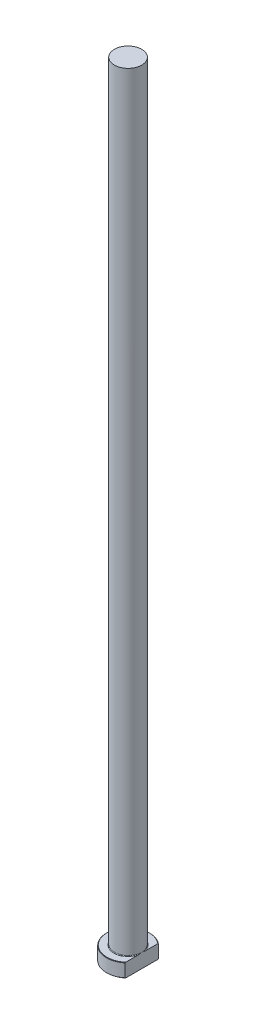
ISO-10303-21;
HEADER;
FILE_DESCRIPTION(('STEP AP214'),'2;1');
FILE_NAME('part.step','',(''),(''),'','','');
FILE_SCHEMA(('AUTOMOTIVE_DESIGN { 1 0 10303 214 1 1 1 1 }'));
ENDSEC;
DATA;
#1=APPLICATION_CONTEXT('core data for automotive mechanical design processes');
#2=APPLICATION_PROTOCOL_DEFINITION('international standard','automotive_design',2000,#1);
#3=PRODUCT_CONTEXT('',#1,'mechanical');
#4=PRODUCT('Part','Part','',(#3));
#5=PRODUCT_RELATED_PRODUCT_CATEGORY('part','',(#4));
#6=PRODUCT_DEFINITION_FORMATION('','',#4);
#7=PRODUCT_DEFINITION_CONTEXT('part definition',#1,'design');
#8=PRODUCT_DEFINITION('design','',#6,#7);
#9=PRODUCT_DEFINITION_SHAPE('','',#8);
#10=(LENGTH_UNIT() NAMED_UNIT(*) SI_UNIT(.MILLI.,.METRE.));
#11=(NAMED_UNIT(*) PLANE_ANGLE_UNIT() SI_UNIT($,.RADIAN.));
#12=(NAMED_UNIT(*) SI_UNIT($,.STERADIAN.) SOLID_ANGLE_UNIT());
#13=UNCERTAINTY_MEASURE_WITH_UNIT(LENGTH_MEASURE(1.E-05),#10,'distance_accuracy_value','');
#14=(GEOMETRIC_REPRESENTATION_CONTEXT(3) GLOBAL_UNCERTAINTY_ASSIGNED_CONTEXT((#13)) GLOBAL_UNIT_ASSIGNED_CONTEXT((#10,
#11,#12)) REPRESENTATION_CONTEXT('',''));
#15=CARTESIAN_POINT('',(0.,0.,0.));
#16=DIRECTION('',(0.,0.,1.));
#17=DIRECTION('',(1.,0.,0.));
#18=AXIS2_PLACEMENT_3D('',#15,#16,#17);
#19=CARTESIAN_POINT('',(0.,0.,0.));
#20=DIRECTION('',(0.,-1.,0.));
#21=DIRECTION('',(0.,0.,-1.));
#22=AXIS2_PLACEMENT_3D('',#19,#20,#21);
#23=PLANE('',#22);
#24=CARTESIAN_POINT('',(0.,0.,0.));
#25=DIRECTION('',(0.,-1.,0.));
#26=DIRECTION('',(0.,0.,-1.));
#27=AXIS2_PLACEMENT_3D('',#24,#25,#26);
#28=CIRCLE('',#27,10.7999999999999);
#29=CARTESIAN_POINT('',(6.99999999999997,0.,8.22435407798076));
#30=VERTEX_POINT('',#29);
#31=CARTESIAN_POINT('',(6.99999999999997,0.,-8.22435407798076));
#32=VERTEX_POINT('',#31);
#33=EDGE_CURVE('E98',#30,#32,#28,.T.);
#34=ORIENTED_EDGE('',*,*,#33,.T.);
#35=DIRECTION('',(0.,0.,1.));
#36=VECTOR('',#35,1.);
#37=CARTESIAN_POINT('',(6.99999999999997,0.,-8.48528137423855));
#38=LINE('',#37,#36);
#39=EDGE_CURVE('E83',#32,#30,#38,.T.);
#40=ORIENTED_EDGE('',*,*,#39,.T.);
#41=EDGE_LOOP('',(#34,#40));
#42=FACE_BOUND('',#41,.T.);
#43=ADVANCED_FACE('F32',(#42),#23,.T.);
#44=CARTESIAN_POINT('',(0.,259.958771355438,0.));
#45=DIRECTION('',(0.,1.,0.));
#46=DIRECTION('',(0.,0.,1.));
#47=AXIS2_PLACEMENT_3D('',#44,#45,#46);
#48=CYLINDRICAL_SURFACE('',#47,11.);
#49=CARTESIAN_POINT('',(0.,6.79999999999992,0.));
#50=DIRECTION('',(0.,1.,0.));
#51=DIRECTION('',(0.,0.,1.));
#52=AXIS2_PLACEMENT_3D('',#49,#50,#51);
#53=CIRCLE('',#52,11.);
#54=CARTESIAN_POINT('',(6.99999999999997,6.79999999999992,8.48528137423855));
#55=VERTEX_POINT('',#54);
#56=CARTESIAN_POINT('',(6.99999999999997,6.79999999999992,-8.48528137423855));
#57=VERTEX_POINT('',#56);
#58=EDGE_CURVE('E104',#55,#57,#53,.F.);
#59=ORIENTED_EDGE('',*,*,#58,.T.);
#60=DIRECTION('',(0.,-1.,0.));
#61=VECTOR('',#60,1.);
#62=CARTESIAN_POINT('',(6.99999999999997,400.,-8.48528137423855));
#63=LINE('',#62,#61);
#64=CARTESIAN_POINT('',(6.99999999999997,0.200000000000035,-8.48528137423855));
#65=VERTEX_POINT('',#64);
#66=EDGE_CURVE('E183',#57,#65,#63,.T.);
#67=ORIENTED_EDGE('',*,*,#66,.T.);
#68=CARTESIAN_POINT('',(0.,0.200000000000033,0.));
#69=DIRECTION('',(0.,-1.,0.));
#70=DIRECTION('',(0.,0.,-1.));
#71=AXIS2_PLACEMENT_3D('',#68,#69,#70);
#72=CIRCLE('',#71,11.);
#73=CARTESIAN_POINT('',(6.99999999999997,0.200000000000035,8.48528137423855));
#74=VERTEX_POINT('',#73);
#75=EDGE_CURVE('E100',#65,#74,#72,.F.);
#76=ORIENTED_EDGE('',*,*,#75,.T.);
#77=DIRECTION('',(0.,-1.,0.));
#78=VECTOR('',#77,1.);
#79=CARTESIAN_POINT('',(6.99999999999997,400.,8.48528137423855));
#80=LINE('',#79,#78);
#81=EDGE_CURVE('E93',#55,#74,#80,.T.);
#82=ORIENTED_EDGE('',*,*,#81,.F.);
#83=EDGE_LOOP('',(#59,#67,#76,#82));
#84=FACE_BOUND('',#83,.T.);
#85=ADVANCED_FACE('F158',(#84),#48,.T.);
#86=CARTESIAN_POINT('',(-11.,7.,0.));
#87=DIRECTION('',(0.,1.,0.));
#88=DIRECTION('',(0.,0.,1.));
#89=AXIS2_PLACEMENT_3D('',#86,#87,#88);
#90=PLANE('',#89);
#91=CARTESIAN_POINT('',(0.,7.,0.));
#92=DIRECTION('',(0.,1.,0.));
#93=DIRECTION('',(0.,0.,1.));
#94=AXIS2_PLACEMENT_3D('',#91,#92,#93);
#95=CIRCLE('',#94,10.7999999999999);
#96=CARTESIAN_POINT('',(6.99999999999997,7.,-8.22435407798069));
#97=VERTEX_POINT('',#96);
#98=CARTESIAN_POINT('',(6.99999999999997,7.,8.22435407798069));
#99=VERTEX_POINT('',#98);
#100=EDGE_CURVE('E178',#97,#99,#95,.T.);
#101=ORIENTED_EDGE('',*,*,#100,.T.);
#102=DIRECTION('',(0.,0.,-1.));
#103=VECTOR('',#102,1.);
#104=CARTESIAN_POINT('',(6.99999999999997,7.,0.));
#105=LINE('',#104,#103);
#106=CARTESIAN_POINT('',(6.99999999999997,6.99999999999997,2.07123151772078));
#107=VERTEX_POINT('',#106);
#108=EDGE_CURVE('E57',#99,#107,#105,.T.);
#109=ORIENTED_EDGE('',*,*,#108,.T.);
#110=CARTESIAN_POINT('',(0.,7.,0.));
#111=DIRECTION('',(0.,1.,0.));
#112=DIRECTION('',(0.,0.,1.));
#113=AXIS2_PLACEMENT_3D('',#110,#111,#112);
#114=CIRCLE('',#113,7.29999999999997);
#115=CARTESIAN_POINT('',(6.99999999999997,6.99999999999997,-2.07123151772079));
#116=VERTEX_POINT('',#115);
#117=EDGE_CURVE('E107',#107,#116,#114,.F.);
#118=ORIENTED_EDGE('',*,*,#117,.T.);
#119=EDGE_CURVE('E136',#116,#97,#105,.T.);
#120=ORIENTED_EDGE('',*,*,#119,.T.);
#121=EDGE_LOOP('',(#101,#109,#118,#120));
#122=FACE_BOUND('',#121,.T.);
#123=ADVANCED_FACE('F147',(#122),#90,.T.);
#124=CARTESIAN_POINT('',(0.,7.00000000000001,0.));
#125=DIRECTION('',(0.,-1.,0.));
#126=DIRECTION('',(0.,0.,-1.));
#127=AXIS2_PLACEMENT_3D('',#124,#125,#126);
#128=CONICAL_SURFACE('',#127,10.7999999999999,0.785398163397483);
#129=ORIENTED_EDGE('',*,*,#58,.F.);
#130=CARTESIAN_POINT('',(6.99999999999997,-2.13774979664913,18.6685261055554));
#131=CARTESIAN_POINT('',(6.99999999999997,-1.86574872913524,18.3780244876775));
#132=CARTESIAN_POINT('',(6.99999999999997,-1.59415659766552,18.0871392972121));
#133=CARTESIAN_POINT('',(6.99999999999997,-1.05192877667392,17.5044755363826));
#134=CARTESIAN_POINT('',(6.99999999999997,-0.781293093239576,17.2126969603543));
#135=CARTESIAN_POINT('',(6.99999999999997,-0.241050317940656,16.6280482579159));
#136=CARTESIAN_POINT('',(6.99999999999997,0.0285564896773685,16.335177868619));
#137=CARTESIAN_POINT('',(6.99999999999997,0.566485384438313,15.7482616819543));
#138=CARTESIAN_POINT('',(6.99999999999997,0.834807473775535,15.4542158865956));
#139=CARTESIAN_POINT('',(6.99999999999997,1.64198377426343,14.5651645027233));
#140=CARTESIAN_POINT('',(6.99999999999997,2.17856420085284,13.9680841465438));
#141=CARTESIAN_POINT('',(6.99999999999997,2.9769633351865,13.0668144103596));
#142=CARTESIAN_POINT('',(6.99999999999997,3.24199785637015,12.7654727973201));
#143=CARTESIAN_POINT('',(6.99999999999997,3.76945856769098,12.1605141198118));
#144=CARTESIAN_POINT('',(6.99999999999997,4.03188476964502,11.8568970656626));
#145=CARTESIAN_POINT('',(6.99999999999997,4.50733797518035,11.3009625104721));
#146=CARTESIAN_POINT('',(6.99999999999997,4.72088020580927,11.0490858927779));
#147=CARTESIAN_POINT('',(6.99999999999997,5.14538078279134,10.5431655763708));
#148=CARTESIAN_POINT('',(6.99999999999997,5.35633915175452,10.2891218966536));
#149=CARTESIAN_POINT('',(6.99999999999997,5.77522964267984,9.77836737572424));
#150=CARTESIAN_POINT('',(6.99999999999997,5.98316044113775,9.5216554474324));
#151=CARTESIAN_POINT('',(6.99999999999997,6.3952109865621,9.00519084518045));
#152=CARTESIAN_POINT('',(6.99999999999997,6.59933078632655,8.74543821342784));
#153=CARTESIAN_POINT('',(6.99999999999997,7.00243445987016,8.22283607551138));
#154=CARTESIAN_POINT('',(6.99999999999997,7.2014281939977,7.95999419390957));
#155=CARTESIAN_POINT('',(6.99999999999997,7.59353840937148,7.42991856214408));
#156=CARTESIAN_POINT('',(6.99999999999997,7.78665447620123,7.1626845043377));
#157=CARTESIAN_POINT('',(6.99999999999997,8.16523718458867,6.62311113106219));
#158=CARTESIAN_POINT('',(6.99999999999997,8.35070911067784,6.35077553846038));
#159=CARTESIAN_POINT('',(6.99999999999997,8.71189725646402,5.79973731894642));
#160=CARTESIAN_POINT('',(6.99999999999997,8.88761537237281,5.52103594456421));
#161=CARTESIAN_POINT('',(6.99999999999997,9.19554959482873,5.00707921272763));
#162=CARTESIAN_POINT('',(6.99999999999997,9.32988075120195,4.77309669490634));
#163=CARTESIAN_POINT('',(6.99999999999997,9.58764253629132,4.29911523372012));
#164=CARTESIAN_POINT('',(6.99999999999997,9.71107181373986,4.05911554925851));
#165=CARTESIAN_POINT('',(6.99999999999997,9.94390907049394,3.57263619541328));
#166=CARTESIAN_POINT('',(6.99999999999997,10.0533307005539,3.32616312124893));
#167=CARTESIAN_POINT('',(6.99999999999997,10.2545146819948,2.82607166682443));
#168=CARTESIAN_POINT('',(6.99999999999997,10.3462820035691,2.57245532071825));
#169=CARTESIAN_POINT('',(6.99999999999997,10.4907049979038,2.11254447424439));
#170=CARTESIAN_POINT('',(6.99999999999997,10.5475277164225,1.90756611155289));
#171=CARTESIAN_POINT('',(6.99999999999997,10.6452043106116,1.49381161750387));
#172=CARTESIAN_POINT('',(6.99999999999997,10.68606033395,1.28503600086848));
#173=CARTESIAN_POINT('',(6.99999999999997,10.7497550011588,0.865342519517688));
#174=CARTESIAN_POINT('',(6.99999999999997,10.7726462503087,0.654432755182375));
#175=CARTESIAN_POINT('',(6.99999999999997,10.7993569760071,0.231396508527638));
#176=CARTESIAN_POINT('',(6.99999999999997,10.8031771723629,0.0192700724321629));
#177=CARTESIAN_POINT('',(6.99999999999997,10.7915178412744,-0.404715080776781));
#178=CARTESIAN_POINT('',(6.99999999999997,10.7760135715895,-0.616573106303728));
#179=CARTESIAN_POINT('',(6.99999999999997,10.7265413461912,-1.03810446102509));
#180=CARTESIAN_POINT('',(6.99999999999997,10.6925718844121,-1.24777761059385));
#181=CARTESIAN_POINT('',(6.99999999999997,10.6077703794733,-1.66430273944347));
#182=CARTESIAN_POINT('',(6.99999999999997,10.5568873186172,-1.87114418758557));
#183=CARTESIAN_POINT('',(6.99999999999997,10.4404729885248,-2.28061279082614));
#184=CARTESIAN_POINT('',(6.99999999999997,10.3749414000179,-2.48323985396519));
#185=CARTESIAN_POINT('',(6.99999999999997,10.219098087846,-2.9186026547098));
#186=CARTESIAN_POINT('',(6.99999999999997,10.1264616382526,-3.15050038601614));
#187=CARTESIAN_POINT('',(6.99999999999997,9.92740958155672,-3.60835455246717));
#188=CARTESIAN_POINT('',(6.99999999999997,9.82098769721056,-3.83430822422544));
#189=CARTESIAN_POINT('',(6.99999999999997,9.5969514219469,-4.28105341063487));
#190=CARTESIAN_POINT('',(6.99999999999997,9.47931762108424,-4.50183511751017));
#191=CARTESIAN_POINT('',(6.99999999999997,9.2352423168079,-4.93840249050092));
#192=CARTESIAN_POINT('',(6.99999999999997,9.10880204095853,-5.15418884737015));
#193=CARTESIAN_POINT('',(6.99999999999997,8.84714657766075,-5.58417945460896));
#194=CARTESIAN_POINT('',(6.99999999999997,8.71183920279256,-5.79832734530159));
#195=CARTESIAN_POINT('',(6.99999999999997,8.43533082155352,-6.22277635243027));
#196=CARTESIAN_POINT('',(6.99999999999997,8.29412966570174,-6.4330773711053));
#197=CARTESIAN_POINT('',(6.99999999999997,8.00706556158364,-6.85014007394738));
#198=CARTESIAN_POINT('',(6.99999999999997,7.86120763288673,-7.0569052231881));
#199=CARTESIAN_POINT('',(6.99999999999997,7.56553131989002,-7.46757278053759));
#200=CARTESIAN_POINT('',(6.99999999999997,7.41571298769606,-7.67147522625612));
#201=CARTESIAN_POINT('',(6.99999999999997,7.07999705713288,-8.12067189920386));
#202=CARTESIAN_POINT('',(6.99999999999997,6.89330819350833,-8.36537403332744));
#203=CARTESIAN_POINT('',(6.99999999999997,6.51597189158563,-8.85171196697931));
#204=CARTESIAN_POINT('',(6.99999999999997,6.3253243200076,-9.09334766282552));
#205=CARTESIAN_POINT('',(6.99999999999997,5.94076020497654,-9.57404667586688));
#206=CARTESIAN_POINT('',(6.99999999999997,5.74684327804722,-9.81310968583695));
#207=CARTESIAN_POINT('',(6.99999999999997,5.35630729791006,-10.2890203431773));
#208=CARTESIAN_POINT('',(6.99999999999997,5.15968820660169,-10.5258679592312));
#209=CARTESIAN_POINT('',(6.99999999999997,4.56606953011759,-11.2340330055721));
#210=CARTESIAN_POINT('',(6.99999999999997,4.16568148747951,-11.702510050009));
#211=CARTESIAN_POINT('',(6.99999999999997,3.35840033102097,-12.633824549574));
#212=CARTESIAN_POINT('',(6.99999999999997,2.95150704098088,-13.0966618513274));
#213=CARTESIAN_POINT('',(6.99999999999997,2.35017562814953,-13.7734103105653));
#214=CARTESIAN_POINT('',(6.99999999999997,2.15763812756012,-13.9890143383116));
#215=CARTESIAN_POINT('',(6.99999999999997,1.77161609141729,-14.4193671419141));
#216=CARTESIAN_POINT('',(6.99999999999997,1.57813157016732,-14.6341159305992));
#217=CARTESIAN_POINT('',(6.99999999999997,0.996412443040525,-15.2772388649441));
#218=CARTESIAN_POINT('',(6.99999999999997,0.606922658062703,-15.7044779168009));
#219=CARTESIAN_POINT('',(6.99999999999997,-0.173895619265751,-16.5556520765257));
#220=CARTESIAN_POINT('',(6.99999999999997,-0.565218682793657,-16.9795921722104));
#221=CARTESIAN_POINT('',(6.99999999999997,-1.34999931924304,-17.8254589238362));
#222=CARTESIAN_POINT('',(6.99999999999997,-1.74345679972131,-18.2473856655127));
#223=CARTESIAN_POINT('',(6.99999999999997,-2.13774979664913,-18.6685261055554));
#224=B_SPLINE_CURVE_WITH_KNOTS('',3,(#130,#131,#132,#133,#134,#135,#136,#137,#138,#139,#140,
#141,#142,#143,#144,#145,#146,#147,#148,#149,#150,#151,#152,#153,#154,#155,#156,#157,#158,#159,
#160,#161,#162,#163,#164,#165,#166,#167,#168,#169,#170,#171,#172,#173,#174,#175,#176,#177,#178,
#179,#180,#181,#182,#183,#184,#185,#186,#187,#188,#189,#190,#191,#192,#193,#194,#195,#196,#197,
#198,#199,#200,#201,#202,#203,#204,#205,#206,#207,#208,#209,#210,#211,#212,#213,#214,#215,#216,
#217,#218,#219,#220,#221,#222,#223),.UNSPECIFIED.,.F.,.F.,(4,2,2,2,2,2,2,2,2,2,2,2,2,2,2,2,2,2,
2,2,2,2,2,2,2,2,2,2,2,2,2,2,2,2,2,2,2,2,2,2,2,2,2,2,2,2,4),(0.,1.19389386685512,
2.38779531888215,3.58200567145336,4.77621398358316,7.18442154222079,8.38834194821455,
9.59225689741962,10.5828886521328,11.5735117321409,12.5645555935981,13.5555857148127,
14.5445404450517,15.5335647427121,16.5218934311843,17.5100293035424,18.3192088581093,
19.1284885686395,19.9369735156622,20.7452305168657,21.3828127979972,22.0203092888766,
22.6559319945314,23.2915307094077,23.9279440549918,24.5644093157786,25.2028120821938,
25.8412287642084,26.5898097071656,27.3387327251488,28.0889766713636,28.8391162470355,
29.5989369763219,30.3587769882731,31.1178239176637,31.876860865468,32.8001653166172,
33.7235009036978,34.6469455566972,35.5704032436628,37.4191008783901,39.2678486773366,
40.1350269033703,41.0021920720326,42.7365692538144,44.4673795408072,46.1981154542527),.UNSPECIFIED.);
#225=EDGE_CURVE('E135',#55,#99,#224,.T.);
#226=ORIENTED_EDGE('',*,*,#225,.T.);
#227=ORIENTED_EDGE('',*,*,#100,.F.);
#228=EDGE_CURVE('E127',#97,#57,#224,.T.);
#229=ORIENTED_EDGE('',*,*,#228,.T.);
#230=EDGE_LOOP('',(#129,#226,#227,#229));
#231=FACE_BOUND('',#230,.T.);
#232=ADVANCED_FACE('F143',(#231),#128,.T.);
#233=CARTESIAN_POINT('',(0.,0.200000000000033,0.));
#234=DIRECTION('',(0.,1.,0.));
#235=DIRECTION('',(0.,0.,1.));
#236=AXIS2_PLACEMENT_3D('',#233,#234,#235);
#237=CONICAL_SURFACE('',#236,11.,0.785398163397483);
#238=ORIENTED_EDGE('',*,*,#75,.F.);
#239=CARTESIAN_POINT('',(6.99999999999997,9.13774979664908,-18.6685261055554));
#240=CARTESIAN_POINT('',(6.99999999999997,8.86574872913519,-18.3780244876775));
#241=CARTESIAN_POINT('',(6.99999999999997,8.59415659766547,-18.0871392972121));
#242=CARTESIAN_POINT('',(6.99999999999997,8.05192877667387,-17.5044755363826));
#243=CARTESIAN_POINT('',(6.99999999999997,7.78129309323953,-17.2126969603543));
#244=CARTESIAN_POINT('',(6.99999999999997,7.24105031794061,-16.6280482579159));
#245=CARTESIAN_POINT('',(6.99999999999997,6.97144351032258,-16.335177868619));
#246=CARTESIAN_POINT('',(6.99999999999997,6.43351461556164,-15.7482616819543));
#247=CARTESIAN_POINT('',(6.99999999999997,6.16519252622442,-15.4542158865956));
#248=CARTESIAN_POINT('',(6.99999999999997,5.35801622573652,-14.5651645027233));
#249=CARTESIAN_POINT('',(6.99999999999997,4.82143579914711,-13.9680841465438));
#250=CARTESIAN_POINT('',(6.99999999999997,4.02303666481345,-13.0668144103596));
#251=CARTESIAN_POINT('',(6.99999999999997,3.7580021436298,-12.7654727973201));
#252=CARTESIAN_POINT('',(6.99999999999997,3.23054143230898,-12.1605141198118));
#253=CARTESIAN_POINT('',(6.99999999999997,2.96811523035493,-11.8568970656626));
#254=CARTESIAN_POINT('',(6.99999999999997,2.4926620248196,-11.3009625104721));
#255=CARTESIAN_POINT('',(6.99999999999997,2.27911979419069,-11.0490858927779));
#256=CARTESIAN_POINT('',(6.99999999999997,1.85461921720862,-10.5431655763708));
#257=CARTESIAN_POINT('',(6.99999999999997,1.64366084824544,-10.2891218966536));
#258=CARTESIAN_POINT('',(6.99999999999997,1.22477035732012,-9.77836737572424));
#259=CARTESIAN_POINT('',(6.99999999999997,1.0168395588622,-9.52165544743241));
#260=CARTESIAN_POINT('',(6.99999999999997,0.60478901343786,-9.00519084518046));
#261=CARTESIAN_POINT('',(6.99999999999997,0.400669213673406,-8.74543821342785));
#262=CARTESIAN_POINT('',(6.99999999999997,-0.00243445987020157,-8.2228360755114));
#263=CARTESIAN_POINT('',(6.99999999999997,-0.201428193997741,-7.95999419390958));
#264=CARTESIAN_POINT('',(6.99999999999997,-0.593538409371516,-7.4299185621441));
#265=CARTESIAN_POINT('',(6.99999999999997,-0.786654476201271,-7.16268450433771));
#266=CARTESIAN_POINT('',(6.99999999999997,-1.16523718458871,-6.6231111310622));
#267=CARTESIAN_POINT('',(6.99999999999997,-1.35070911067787,-6.3507755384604));
#268=CARTESIAN_POINT('',(6.99999999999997,-1.71189725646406,-5.79973731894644));
#269=CARTESIAN_POINT('',(6.99999999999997,-1.88761537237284,-5.52103594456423));
#270=CARTESIAN_POINT('',(6.99999999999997,-2.19554959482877,-5.00707921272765));
#271=CARTESIAN_POINT('',(6.99999999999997,-2.32988075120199,-4.77309669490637));
#272=CARTESIAN_POINT('',(6.99999999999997,-2.58764253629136,-4.29911523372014));
#273=CARTESIAN_POINT('',(6.99999999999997,-2.7110718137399,-4.05911554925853));
#274=CARTESIAN_POINT('',(6.99999999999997,-2.94390907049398,-3.5726361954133));
#275=CARTESIAN_POINT('',(6.99999999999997,-3.05333070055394,-3.32616312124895));
#276=CARTESIAN_POINT('',(6.99999999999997,-3.25451468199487,-2.82607166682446));
#277=CARTESIAN_POINT('',(6.99999999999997,-3.34628200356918,-2.57245532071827));
#278=CARTESIAN_POINT('',(6.99999999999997,-3.49070499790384,-2.11254447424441));
#279=CARTESIAN_POINT('',(6.99999999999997,-3.54752771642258,-1.90756611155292));
#280=CARTESIAN_POINT('',(6.99999999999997,-3.64520431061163,-1.49381161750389));
#281=CARTESIAN_POINT('',(6.99999999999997,-3.68606033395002,-1.2850360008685));
#282=CARTESIAN_POINT('',(6.99999999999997,-3.74975500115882,-0.865342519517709));
#283=CARTESIAN_POINT('',(6.99999999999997,-3.77264625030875,-0.654432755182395));
#284=CARTESIAN_POINT('',(6.99999999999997,-3.79935697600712,-0.231396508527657));
#285=CARTESIAN_POINT('',(6.99999999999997,-3.80317717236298,-0.0192700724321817));
#286=CARTESIAN_POINT('',(6.99999999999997,-3.79151784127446,0.404715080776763));
#287=CARTESIAN_POINT('',(6.99999999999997,-3.77601357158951,0.61657310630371));
#288=CARTESIAN_POINT('',(6.99999999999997,-3.72654134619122,1.03810446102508));
#289=CARTESIAN_POINT('',(6.99999999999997,-3.69257188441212,1.24777761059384));
#290=CARTESIAN_POINT('',(6.99999999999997,-3.60777037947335,1.66430273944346));
#291=CARTESIAN_POINT('',(6.99999999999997,-3.55688731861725,1.87114418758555));
#292=CARTESIAN_POINT('',(6.99999999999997,-3.44047298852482,2.28061279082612));
#293=CARTESIAN_POINT('',(6.99999999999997,-3.374941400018,2.48323985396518));
#294=CARTESIAN_POINT('',(6.99999999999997,-3.2190980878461,2.91860265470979));
#295=CARTESIAN_POINT('',(6.99999999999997,-3.12646163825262,3.15050038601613));
#296=CARTESIAN_POINT('',(6.99999999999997,-2.92740958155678,3.60835455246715));
#297=CARTESIAN_POINT('',(6.99999999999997,-2.82098769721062,3.83430822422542));
#298=CARTESIAN_POINT('',(6.99999999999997,-2.59695142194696,4.28105341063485));
#299=CARTESIAN_POINT('',(6.99999999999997,-2.4793176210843,4.50183511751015));
#300=CARTESIAN_POINT('',(6.99999999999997,-2.23524231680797,4.9384024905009));
#301=CARTESIAN_POINT('',(6.99999999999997,-2.1088020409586,5.15418884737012));
#302=CARTESIAN_POINT('',(6.99999999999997,-1.84714657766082,5.58417945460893));
#303=CARTESIAN_POINT('',(6.99999999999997,-1.71183920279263,5.79832734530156));
#304=CARTESIAN_POINT('',(6.99999999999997,-1.43533082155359,6.22277635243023));
#305=CARTESIAN_POINT('',(6.99999999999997,-1.29412966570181,6.43307737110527));
#306=CARTESIAN_POINT('',(6.99999999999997,-1.00706556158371,6.85014007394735));
#307=CARTESIAN_POINT('',(6.99999999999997,-0.861207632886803,7.05690522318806));
#308=CARTESIAN_POINT('',(6.99999999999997,-0.5655313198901,7.46757278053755));
#309=CARTESIAN_POINT('',(6.99999999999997,-0.415712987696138,7.67147522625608));
#310=CARTESIAN_POINT('',(6.99999999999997,-0.0799970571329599,8.12067189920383));
#311=CARTESIAN_POINT('',(6.99999999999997,0.10669180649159,8.36537403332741));
#312=CARTESIAN_POINT('',(6.99999999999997,0.484028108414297,8.85171196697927));
#313=CARTESIAN_POINT('',(6.99999999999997,0.674675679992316,9.09334766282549));
#314=CARTESIAN_POINT('',(6.99999999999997,1.05923979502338,9.57404667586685));
#315=CARTESIAN_POINT('',(6.99999999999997,1.25315672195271,9.81310968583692));
#316=CARTESIAN_POINT('',(6.99999999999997,1.64369270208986,10.2890203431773));
#317=CARTESIAN_POINT('',(6.99999999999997,1.84031179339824,10.5258679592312));
#318=CARTESIAN_POINT('',(6.99999999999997,2.43393046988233,11.2340330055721));
#319=CARTESIAN_POINT('',(6.99999999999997,2.83431851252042,11.702510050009));
#320=CARTESIAN_POINT('',(6.99999999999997,3.64159966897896,12.633824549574));
#321=CARTESIAN_POINT('',(6.99999999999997,4.04849295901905,13.0966618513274));
#322=CARTESIAN_POINT('',(6.99999999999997,4.64982437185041,13.7734103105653));
#323=CARTESIAN_POINT('',(6.99999999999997,4.84236187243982,13.9890143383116));
#324=CARTESIAN_POINT('',(6.99999999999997,5.22838390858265,14.4193671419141));
#325=CARTESIAN_POINT('',(6.99999999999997,5.42186842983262,14.6341159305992));
#326=CARTESIAN_POINT('',(6.99999999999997,6.00358755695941,15.2772388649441));
#327=CARTESIAN_POINT('',(6.99999999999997,6.39307734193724,15.7044779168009));
#328=CARTESIAN_POINT('',(6.99999999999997,7.17389561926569,16.5556520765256));
#329=CARTESIAN_POINT('',(6.99999999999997,7.5652186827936,16.9795921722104));
#330=CARTESIAN_POINT('',(6.99999999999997,8.34999931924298,17.8254589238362));
#331=CARTESIAN_POINT('',(6.99999999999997,8.74345679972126,18.2473856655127));
#332=CARTESIAN_POINT('',(6.99999999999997,9.13774979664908,18.6685261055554));
#333=B_SPLINE_CURVE_WITH_KNOTS('',3,(#239,#240,#241,#242,#243,#244,#245,#246,#247,#248,#249,
#250,#251,#252,#253,#254,#255,#256,#257,#258,#259,#260,#261,#262,#263,#264,#265,#266,#267,#268,
#269,#270,#271,#272,#273,#274,#275,#276,#277,#278,#279,#280,#281,#282,#283,#284,#285,#286,#287,
#288,#289,#290,#291,#292,#293,#294,#295,#296,#297,#298,#299,#300,#301,#302,#303,#304,#305,#306,
#307,#308,#309,#310,#311,#312,#313,#314,#315,#316,#317,#318,#319,#320,#321,#322,#323,#324,#325,
#326,#327,#328,#329,#330,#331,#332),.UNSPECIFIED.,.F.,.F.,(4,2,2,2,2,2,2,2,2,2,2,2,2,2,2,2,2,2,
2,2,2,2,2,2,2,2,2,2,2,2,2,2,2,2,2,2,2,2,2,2,2,2,2,2,2,2,4),(0.,1.19389386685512,
2.38779531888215,3.58200567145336,4.77621398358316,7.18442154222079,8.38834194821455,
9.59225689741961,10.5828886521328,11.5735117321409,12.5645555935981,13.5555857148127,
14.5445404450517,15.5335647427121,16.5218934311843,17.5100293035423,18.3192088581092,
19.1284885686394,19.9369735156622,20.7452305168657,21.3828127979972,22.0203092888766,
22.6559319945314,23.2915307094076,23.9279440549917,24.5644093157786,25.2028120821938,
25.8412287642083,26.5898097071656,27.3387327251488,28.0889766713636,28.8391162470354,
29.5989369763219,30.3587769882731,31.1178239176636,31.876860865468,32.8001653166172,
33.7235009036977,34.6469455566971,35.5704032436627,37.41910087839,39.2678486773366,
40.1350269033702,41.0021920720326,42.7365692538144,44.4673795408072,46.1981154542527),.UNSPECIFIED.);
#334=EDGE_CURVE('E86',#65,#32,#333,.T.);
#335=ORIENTED_EDGE('',*,*,#334,.T.);
#336=ORIENTED_EDGE('',*,*,#33,.F.);
#337=EDGE_CURVE('E89',#30,#74,#333,.T.);
#338=ORIENTED_EDGE('',*,*,#337,.T.);
#339=EDGE_LOOP('',(#238,#335,#336,#338));
#340=FACE_BOUND('',#339,.T.);
#341=ADVANCED_FACE('F97',(#340),#237,.T.);
#342=CARTESIAN_POINT('',(0.,7.29999999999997,0.));
#343=DIRECTION('',(0.,1.,0.));
#344=DIRECTION('',(0.,0.,1.));
#345=AXIS2_PLACEMENT_3D('',#342,#343,#344);
#346=TOROIDAL_SURFACE('',#345,7.29999999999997,0.3);
#347=CARTESIAN_POINT('',(6.99999999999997,7.29999999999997,0.));
#348=CARTESIAN_POINT('',(6.99999999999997,7.30000062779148,2.32628005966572E-11));
#349=CARTESIAN_POINT('',(6.99999999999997,7.30000125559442,-3.16909134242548E-07));
#350=CARTESIAN_POINT('',(6.99999999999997,7.30000241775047,-1.14637029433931E-06));
#351=CARTESIAN_POINT('',(6.99999999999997,7.30000292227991,-1.68168827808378E-06));
#352=CARTESIAN_POINT('',(6.99999999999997,7.30000400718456,-2.97869768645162E-06));
#353=CARTESIAN_POINT('',(6.99999999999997,7.30000456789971,-3.76131367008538E-06));
#354=CARTESIAN_POINT('',(6.99999999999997,7.30000553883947,-5.35167977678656E-06));
#355=CARTESIAN_POINT('',(6.99999999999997,7.30000595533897,-6.15604635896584E-06));
#356=CARTESIAN_POINT('',(6.99999999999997,7.30000758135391,-9.388029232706E-06));
#357=CARTESIAN_POINT('',(6.99999999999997,7.30000871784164,-1.18573464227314E-05));
#358=CARTESIAN_POINT('',(6.99999999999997,7.30001050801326,-1.66549715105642E-05));
#359=CARTESIAN_POINT('',(6.99999999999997,7.30001120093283,-1.89691200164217E-05));
#360=CARTESIAN_POINT('',(6.99999999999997,7.30001423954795,-2.9073526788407E-05));
#361=CARTESIAN_POINT('',(6.99999999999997,7.30001661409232,-3.68567169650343E-05));
#362=CARTESIAN_POINT('',(6.99999999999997,7.30001997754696,-5.13387672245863E-05));
#363=CARTESIAN_POINT('',(6.99999999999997,7.30002113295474,-5.79981986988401E-05));
#364=CARTESIAN_POINT('',(6.99999999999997,7.30002974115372,-0.000108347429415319));
#365=CARTESIAN_POINT('',(6.99999999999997,7.30003649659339,-0.000152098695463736));
#366=CARTESIAN_POINT('',(6.99999999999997,7.30006604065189,-0.000326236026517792));
#367=CARTESIAN_POINT('',(6.99999999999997,7.30009398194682,-0.000455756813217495));
#368=CARTESIAN_POINT('',(6.99999999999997,7.30020370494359,-0.000971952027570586));
#369=CARTESIAN_POINT('',(6.99999999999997,7.30028233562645,-0.00135905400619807));
#370=CARTESIAN_POINT('',(6.99999999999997,7.30059908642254,-0.00290811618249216));
#371=CARTESIAN_POINT('',(6.99999999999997,7.30084128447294,-0.00406949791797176));
#372=CARTESIAN_POINT('',(6.99999999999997,7.30185637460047,-0.00894870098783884));
#373=CARTESIAN_POINT('',(6.99999999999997,7.30262406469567,-0.0126672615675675));
#374=CARTESIAN_POINT('',(6.99999999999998,7.30904362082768,-0.0437472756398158));
#375=CARTESIAN_POINT('',(6.99999999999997,7.31471492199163,-0.0711060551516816));
#376=CARTESIAN_POINT('',(6.99999999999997,7.3257989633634,-0.124711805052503));
#377=CARTESIAN_POINT('',(6.99999999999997,7.33121280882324,-0.150958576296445));
#378=CARTESIAN_POINT('',(6.99999999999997,7.34888721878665,-0.236855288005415));
#379=CARTESIAN_POINT('',(6.99999999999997,7.36109504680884,-0.296516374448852));
#380=CARTESIAN_POINT('',(6.99999999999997,7.38163193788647,-0.398125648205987));
#381=CARTESIAN_POINT('',(6.99999999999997,7.39003371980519,-0.440059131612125));
#382=CARTESIAN_POINT('',(6.99999999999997,7.40641913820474,-0.522820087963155));
#383=CARTESIAN_POINT('',(6.99999999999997,7.41440792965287,-0.563646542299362));
#384=CARTESIAN_POINT('',(6.99999999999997,7.44025584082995,-0.697745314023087));
#385=CARTESIAN_POINT('',(6.99999999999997,7.45763052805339,-0.791112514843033));
#386=CARTESIAN_POINT('',(6.99999999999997,7.4907040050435,-0.979068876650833));
#387=CARTESIAN_POINT('',(6.99999999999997,7.50638514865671,-1.07366117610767));
#388=CARTESIAN_POINT('',(6.99999999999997,7.53649600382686,-1.27237182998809));
#389=CARTESIAN_POINT('',(6.99999999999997,7.55066037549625,-1.37653153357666));
#390=CARTESIAN_POINT('',(6.99999999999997,7.57450660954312,-1.58508707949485));
#391=CARTESIAN_POINT('',(6.99999999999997,7.58420070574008,-1.68948148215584));
#392=CARTESIAN_POINT('',(6.99999999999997,7.5971656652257,-1.89515538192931));
#393=CARTESIAN_POINT('',(6.99999999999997,7.60064432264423,-1.9964196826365));
#394=CARTESIAN_POINT('',(6.99999999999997,7.59954163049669,-2.14745317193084));
#395=CARTESIAN_POINT('',(6.99999999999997,7.59815772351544,-2.19724153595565));
#396=CARTESIAN_POINT('',(6.99999999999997,7.59283451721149,-2.29666246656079));
#397=CARTESIAN_POINT('',(6.99999999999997,7.58889656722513,-2.34629510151));
#398=CARTESIAN_POINT('',(6.99999999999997,7.57769755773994,-2.44571674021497));
#399=CARTESIAN_POINT('',(6.99999999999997,7.57040396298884,-2.49550242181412));
#400=CARTESIAN_POINT('',(6.99999999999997,7.5560244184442,-2.56951537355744));
#401=CARTESIAN_POINT('',(6.99999999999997,7.55065780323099,-2.59407625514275));
#402=CARTESIAN_POINT('',(6.99999999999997,7.53852479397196,-2.642845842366));
#403=CARTESIAN_POINT('',(6.99999999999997,7.53175908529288,-2.66705471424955));
#404=CARTESIAN_POINT('',(6.99999999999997,7.5174892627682,-2.71174649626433));
#405=CARTESIAN_POINT('',(6.99999999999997,7.510201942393,-2.73229789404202));
#406=CARTESIAN_POINT('',(6.99999999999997,7.4939308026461,-2.77282387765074));
#407=CARTESIAN_POINT('',(6.99999999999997,7.4849410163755,-2.79279614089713));
#408=CARTESIAN_POINT('',(6.99999999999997,7.46462265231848,-2.83190553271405));
#409=CARTESIAN_POINT('',(6.99999999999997,7.45326134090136,-2.85102586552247));
#410=CARTESIAN_POINT('',(6.99999999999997,7.4274542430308,-2.88704231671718));
#411=CARTESIAN_POINT('',(6.99999999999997,7.41303489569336,-2.90395561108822));
#412=CARTESIAN_POINT('',(6.99999999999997,7.39049681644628,-2.92384155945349));
#413=CARTESIAN_POINT('',(6.99999999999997,7.3841904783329,-2.92884725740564));
#414=CARTESIAN_POINT('',(6.99999999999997,7.3709718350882,-2.9380049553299));
#415=CARTESIAN_POINT('',(6.99999999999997,7.36405938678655,-2.94215675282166));
#416=CARTESIAN_POINT('',(6.99999999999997,7.34956926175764,-2.94936604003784));
#417=CARTESIAN_POINT('',(6.99999999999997,7.34198467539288,-2.95240998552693));
#418=CARTESIAN_POINT('',(6.99999999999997,7.32637763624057,-2.95700924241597));
#419=CARTESIAN_POINT('',(6.99999999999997,7.31835605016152,-2.95856739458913));
#420=CARTESIAN_POINT('',(6.99999999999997,7.3029104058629,-2.95992508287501));
#421=CARTESIAN_POINT('',(6.99999999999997,7.29549953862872,-2.95987367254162));
#422=CARTESIAN_POINT('',(6.99999999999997,7.28081803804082,-2.95838504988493));
#423=CARTESIAN_POINT('',(6.99999999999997,7.27354749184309,-2.95694700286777));
#424=CARTESIAN_POINT('',(6.99999999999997,7.25853285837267,-2.95260391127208));
#425=CARTESIAN_POINT('',(6.99999999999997,7.25083383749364,-2.94954604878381));
#426=CARTESIAN_POINT('',(6.99999999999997,7.23603628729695,-2.9422241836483));
#427=CARTESIAN_POINT('',(6.99999999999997,7.22893877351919,-2.93795819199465));
#428=CARTESIAN_POINT('',(6.99999999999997,7.21163875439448,-2.92593351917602));
#429=CARTESIAN_POINT('',(6.99999999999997,7.20187862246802,-2.91754511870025));
#430=CARTESIAN_POINT('',(6.99999999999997,7.18370674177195,-2.89942475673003));
#431=CARTESIAN_POINT('',(6.99999999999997,7.17529892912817,-2.88968902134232));
#432=CARTESIAN_POINT('',(6.99999999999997,7.15199560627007,-2.85953893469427));
#433=CARTESIAN_POINT('',(6.99999999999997,7.13869481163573,-2.83790736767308));
#434=CARTESIAN_POINT('',(6.99999999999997,7.11507068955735,-2.79314645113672));
#435=CARTESIAN_POINT('',(6.99999999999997,7.10475206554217,-2.77001480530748));
#436=CARTESIAN_POINT('',(6.99999999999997,7.08155610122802,-2.7108784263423));
#437=CARTESIAN_POINT('',(6.99999999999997,7.07006528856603,-2.67433519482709));
#438=CARTESIAN_POINT('',(6.99999999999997,7.05044959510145,-2.60033159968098));
#439=CARTESIAN_POINT('',(6.99999999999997,7.04233234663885,-2.5628693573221));
#440=CARTESIAN_POINT('',(6.99999999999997,7.02853576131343,-2.48688638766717));
#441=CARTESIAN_POINT('',(6.99999999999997,7.02289758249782,-2.4483583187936));
#442=CARTESIAN_POINT('',(6.99999999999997,7.01369461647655,-2.37112071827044));
#443=CARTESIAN_POINT('',(6.99999999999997,7.01012698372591,-2.33241150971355));
#444=CARTESIAN_POINT('',(6.99999999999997,7.00239886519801,-2.22280038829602));
#445=CARTESIAN_POINT('',(6.99999999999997,7.00019016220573,-2.15176184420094));
#446=CARTESIAN_POINT('',(6.99999999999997,6.99983406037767,-2.0096618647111));
#447=CARTESIAN_POINT('',(6.99999999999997,7.00168936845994,-1.9386004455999));
#448=CARTESIAN_POINT('',(6.99999999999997,7.00854815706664,-1.79630907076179));
#449=CARTESIAN_POINT('',(6.99999999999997,7.01356610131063,-1.7250798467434));
#450=CARTESIAN_POINT('',(6.99999999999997,7.02608998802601,-1.5828366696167));
#451=CARTESIAN_POINT('',(6.99999999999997,7.03359634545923,-1.51182275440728));
#452=CARTESIAN_POINT('',(6.99999999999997,7.0575822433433,-1.31152735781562));
#453=CARTESIAN_POINT('',(6.99999999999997,7.07635481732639,-1.18252326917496));
#454=CARTESIAN_POINT('',(6.99999999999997,7.11790553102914,-0.926646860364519));
#455=CARTESIAN_POINT('',(6.99999999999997,7.14063741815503,-0.799766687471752));
#456=CARTESIAN_POINT('',(6.99999999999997,7.17322033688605,-0.627620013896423));
#457=CARTESIAN_POINT('',(6.99999999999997,7.18199317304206,-0.582145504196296));
#458=CARTESIAN_POINT('',(6.99999999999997,7.20004716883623,-0.489938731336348));
#459=CARTESIAN_POINT('',(6.99999999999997,7.20933569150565,-0.443207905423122));
#460=CARTESIAN_POINT('',(6.99999999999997,7.22546843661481,-0.362914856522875));
#461=CARTESIAN_POINT('',(6.99999999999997,7.23226586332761,-0.329343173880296));
#462=CARTESIAN_POINT('',(6.99999999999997,7.24586025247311,-0.262588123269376));
#463=CARTESIAN_POINT('',(6.99999999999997,7.25265638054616,-0.22940458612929));
#464=CARTESIAN_POINT('',(6.99999999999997,7.26550614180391,-0.166874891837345));
#465=CARTESIAN_POINT('',(6.99999999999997,7.27155497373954,-0.137527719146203));
#466=CARTESIAN_POINT('',(6.99999999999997,7.28394498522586,-0.0775831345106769));
#467=CARTESIAN_POINT('',(6.99999999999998,7.29028759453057,-0.0469859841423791));
#468=CARTESIAN_POINT('',(6.99999999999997,7.29737625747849,-0.0126656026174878));
#469=CARTESIAN_POINT('',(6.99999999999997,7.29814430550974,-0.00894538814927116));
#470=CARTESIAN_POINT('',(6.99999999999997,7.29915947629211,-0.00406582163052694));
#471=CARTESIAN_POINT('',(6.99999999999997,7.29940140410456,-0.00290573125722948));
#472=CARTESIAN_POINT('',(6.99999999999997,7.29971782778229,-0.00135826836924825));
#473=CARTESIAN_POINT('',(6.99999999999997,7.29979639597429,-0.000971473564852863));
#474=CARTESIAN_POINT('',(6.99999999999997,7.29990604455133,-0.000455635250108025));
#475=CARTESIAN_POINT('',(6.99999999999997,7.2999339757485,-0.00032616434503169));
#476=CARTESIAN_POINT('',(6.99999999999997,7.29996351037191,-0.000152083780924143));
#477=CARTESIAN_POINT('',(6.99999999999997,7.29997026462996,-0.000108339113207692));
#478=CARTESIAN_POINT('',(6.99999999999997,7.29997887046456,-5.7996672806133E-05));
#479=CARTESIAN_POINT('',(6.99999999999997,7.29998002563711,-5.13375704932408E-05));
#480=CARTESIAN_POINT('',(6.99999999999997,7.29998338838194,-3.6856228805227E-05));
#481=CARTESIAN_POINT('',(6.99999999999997,7.29998576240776,-2.90734013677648E-05));
#482=CARTESIAN_POINT('',(6.99999999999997,7.29998880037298,-1.8969379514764E-05));
#483=CARTESIAN_POINT('',(6.99999999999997,7.29998949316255,-1.6655255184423E-05));
#484=CARTESIAN_POINT('',(6.99999999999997,7.29999128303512,-1.18576604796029E-05));
#485=CARTESIAN_POINT('',(6.99999999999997,7.29999241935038,-9.38834597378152E-06));
#486=CARTESIAN_POINT('',(6.99999999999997,7.29999404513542,-6.15634598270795E-06));
#487=CARTESIAN_POINT('',(6.99999999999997,7.29999446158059,-5.35196743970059E-06));
#488=CARTESIAN_POINT('',(6.99999999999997,7.29999543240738,-3.76156762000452E-06));
#489=CARTESIAN_POINT('',(6.99999999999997,7.29999599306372,-2.97892931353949E-06));
#490=CARTESIAN_POINT('',(6.99999999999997,7.29999707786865,-1.68186918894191E-06));
#491=CARTESIAN_POINT('',(6.99999999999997,7.29999758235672,-1.14652503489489E-06));
#492=CARTESIAN_POINT('',(6.99999999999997,7.2999987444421,-3.16995271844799E-07));
#493=CARTESIAN_POINT('',(6.99999999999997,7.29999937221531,-2.32625469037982E-11));
#494=CARTESIAN_POINT('',(6.99999999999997,7.29999999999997,0.));
#495=B_SPLINE_CURVE_WITH_KNOTS('',3,(#347,#348,#349,#350,#351,#352,#353,#354,#355,#356,#357,
#358,#359,#360,#361,#362,#363,#364,#365,#366,#367,#368,#369,#370,#371,#372,#373,#374,#375,#376,
#377,#378,#379,#380,#381,#382,#383,#384,#385,#386,#387,#388,#389,#390,#391,#392,#393,#394,#395,
#396,#397,#398,#399,#400,#401,#402,#403,#404,#405,#406,#407,#408,#409,#410,#411,#412,#413,#414,
#415,#416,#417,#418,#419,#420,#421,#422,#423,#424,#425,#426,#427,#428,#429,#430,#431,#432,#433,
#434,#435,#436,#437,#438,#439,#440,#441,#442,#443,#444,#445,#446,#447,#448,#449,#450,#451,#452,
#453,#454,#455,#456,#457,#458,#459,#460,#461,#462,#463,#464,#465,#466,#467,#468,#469,#470,#471,
#472,#473,#474,#475,#476,#477,#478,#479,#480,#481,#482,#483,#484,#485,#486,#487,#488,#489,#490,
#491,#492,#493,#494),.UNSPECIFIED.,.T.,.F.,(4,2,2,2,2,2,2,2,2,2,2,2,2,2,2,2,2,2,2,2,2,2,2,2,2,2,
2,2,2,2,2,2,2,2,2,2,2,2,2,2,2,2,2,2,2,2,2,2,2,2,2,2,2,2,2,2,2,2,2,2,2,2,2,2,2,2,2,2,2,2,2,2,2,
4),(0.,1.92694204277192E-06,4.154269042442E-06,7.01948468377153E-06,9.73677790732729E-06,
1.78669784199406E-05,2.510708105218E-05,4.94892168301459E-05,6.97447136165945E-05,
0.000202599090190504,0.000599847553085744,0.00178514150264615,0.00534391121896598,
0.0167352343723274,0.100554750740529,0.180953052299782,0.36364407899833,0.491944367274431,
0.616746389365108,0.901643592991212,1.18926961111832,1.50455392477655,1.81897020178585,
2.12266301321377,2.27203455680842,2.42132724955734,2.57209897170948,2.64748997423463,
2.72284413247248,2.7882086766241,2.85380670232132,2.92037838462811,2.98639639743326,
3.01049823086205,3.03460577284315,3.05899886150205,3.08334521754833,3.10544427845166,
3.12755665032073,3.15227309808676,3.17703047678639,3.21542082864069,3.25392097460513,
3.32967543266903,3.4055487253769,3.52018968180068,3.63508860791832,3.75182904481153,
3.86840866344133,4.08144496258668,4.29462320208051,4.5087835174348,4.72297956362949,
5.11393929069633,5.50060554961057,5.63954426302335,5.78247850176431,5.8852372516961,
5.98685401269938,6.07674665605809,6.17048759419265,6.18188399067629,6.18543880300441,
6.18662315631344,6.18702025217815,6.18715308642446,6.18717334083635,6.18719772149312,
6.18720496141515,6.18721309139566,6.1872158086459,6.18721867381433,6.18722090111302,
6.18722282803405),.UNSPECIFIED.);
#496=CARTESIAN_POINT('',(6.99999999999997,7.29999999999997,0.));
#497=VERTEX_POINT('',#496);
#498=EDGE_CURVE('E11',#116,#497,#495,.T.);
#499=ORIENTED_EDGE('',*,*,#498,.F.);
#500=ORIENTED_EDGE('',*,*,#117,.F.);
#501=CARTESIAN_POINT('',(6.99999999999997,7.29999999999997,0.));
#502=CARTESIAN_POINT('',(6.99999999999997,7.29999937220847,-2.32626743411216E-11));
#503=CARTESIAN_POINT('',(6.99999999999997,7.29999874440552,3.16909134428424E-07));
#504=CARTESIAN_POINT('',(6.99999999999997,7.29999758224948,1.14637029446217E-06));
#505=CARTESIAN_POINT('',(6.99999999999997,7.29999707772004,1.68168827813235E-06));
#506=CARTESIAN_POINT('',(6.99999999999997,7.29999599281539,2.97869768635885E-06));
#507=CARTESIAN_POINT('',(6.99999999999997,7.29999543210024,3.76131366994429E-06));
#508=CARTESIAN_POINT('',(6.99999999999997,7.29999446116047,5.35167977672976E-06));
#509=CARTESIAN_POINT('',(6.99999999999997,7.29999404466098,6.15604635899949E-06));
#510=CARTESIAN_POINT('',(6.99999999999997,7.29999241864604,9.38802923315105E-06));
#511=CARTESIAN_POINT('',(6.99999999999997,7.29999128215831,1.18573464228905E-05));
#512=CARTESIAN_POINT('',(6.99999999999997,7.29998949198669,1.66549715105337E-05));
#513=CARTESIAN_POINT('',(6.99999999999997,7.29998879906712,1.8969120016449E-05));
#514=CARTESIAN_POINT('',(6.99999999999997,7.29998576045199,2.90735267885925E-05));
#515=CARTESIAN_POINT('',(6.99999999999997,7.29998338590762,3.68567169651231E-05));
#516=CARTESIAN_POINT('',(6.99999999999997,7.29998002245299,5.13387672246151E-05));
#517=CARTESIAN_POINT('',(6.99999999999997,7.2999788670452,5.7998198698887E-05));
#518=CARTESIAN_POINT('',(6.99999999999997,7.29997025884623,0.00010834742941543));
#519=CARTESIAN_POINT('',(6.99999999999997,7.29996350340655,0.000152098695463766));
#520=CARTESIAN_POINT('',(6.99999999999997,7.29993395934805,0.000326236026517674));
#521=CARTESIAN_POINT('',(6.99999999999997,7.29990601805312,0.000455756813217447));
#522=CARTESIAN_POINT('',(6.99999999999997,7.29979629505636,0.0009719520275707));
#523=CARTESIAN_POINT('',(6.99999999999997,7.2997176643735,0.00135905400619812));
#524=CARTESIAN_POINT('',(6.99999999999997,7.29940091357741,0.00290811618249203));
#525=CARTESIAN_POINT('',(6.99999999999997,7.29915871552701,0.0040694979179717));
#526=CARTESIAN_POINT('',(6.99999999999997,7.29814362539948,0.00894870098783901));
#527=CARTESIAN_POINT('',(6.99999999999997,7.29737593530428,0.0126672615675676));
#528=CARTESIAN_POINT('',(6.99999999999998,7.29095637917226,0.0437472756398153));
#529=CARTESIAN_POINT('',(6.99999999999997,7.28528507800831,0.0711060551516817));
#530=CARTESIAN_POINT('',(6.99999999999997,7.27420103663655,0.124711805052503));
#531=CARTESIAN_POINT('',(6.99999999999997,7.2687871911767,0.150958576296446));
#532=CARTESIAN_POINT('',(6.99999999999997,7.25111278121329,0.236855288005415));
#533=CARTESIAN_POINT('',(6.99999999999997,7.23890495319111,0.296516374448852));
#534=CARTESIAN_POINT('',(6.99999999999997,7.21836806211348,0.398125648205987));
#535=CARTESIAN_POINT('',(6.99999999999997,7.20996628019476,0.440059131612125));
#536=CARTESIAN_POINT('',(6.99999999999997,7.1935808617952,0.522820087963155));
#537=CARTESIAN_POINT('',(6.99999999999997,7.18559207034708,0.563646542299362));
#538=CARTESIAN_POINT('',(6.99999999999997,7.15974415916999,0.697745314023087));
#539=CARTESIAN_POINT('',(6.99999999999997,7.14236947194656,0.791112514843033));
#540=CARTESIAN_POINT('',(6.99999999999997,7.10929599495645,0.979068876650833));
#541=CARTESIAN_POINT('',(6.99999999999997,7.09361485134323,1.07366117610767));
#542=CARTESIAN_POINT('',(6.99999999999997,7.06350399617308,1.27237182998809));
#543=CARTESIAN_POINT('',(6.99999999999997,7.04933962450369,1.37653153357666));
#544=CARTESIAN_POINT('',(6.99999999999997,7.02549339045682,1.58508707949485));
#545=CARTESIAN_POINT('',(6.99999999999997,7.01579929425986,1.68948148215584));
#546=CARTESIAN_POINT('',(6.99999999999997,7.00283433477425,1.89515538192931));
#547=CARTESIAN_POINT('',(6.99999999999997,6.99935567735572,1.9964196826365));
#548=CARTESIAN_POINT('',(6.99999999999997,7.00045836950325,2.14745317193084));
#549=CARTESIAN_POINT('',(6.99999999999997,7.0018422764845,2.19724153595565));
#550=CARTESIAN_POINT('',(6.99999999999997,7.00716548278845,2.29666246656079));
#551=CARTESIAN_POINT('',(6.99999999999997,7.01110343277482,2.34629510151));
#552=CARTESIAN_POINT('',(6.99999999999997,7.02230244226,2.44571674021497));
#553=CARTESIAN_POINT('',(6.99999999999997,7.02959603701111,2.49550242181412));
#554=CARTESIAN_POINT('',(6.99999999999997,7.04397558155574,2.56951537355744));
#555=CARTESIAN_POINT('',(6.99999999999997,7.04934219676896,2.59407625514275));
#556=CARTESIAN_POINT('',(6.99999999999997,7.06147520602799,2.642845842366));
#557=CARTESIAN_POINT('',(6.99999999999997,7.06824091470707,2.66705471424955));
#558=CARTESIAN_POINT('',(6.99999999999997,7.08251073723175,2.71174649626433));
#559=CARTESIAN_POINT('',(6.99999999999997,7.08979805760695,2.73229789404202));
#560=CARTESIAN_POINT('',(6.99999999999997,7.10606919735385,2.77282387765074));
#561=CARTESIAN_POINT('',(6.99999999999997,7.11505898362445,2.79279614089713));
#562=CARTESIAN_POINT('',(6.99999999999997,7.13537734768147,2.83190553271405));
#563=CARTESIAN_POINT('',(6.99999999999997,7.14673865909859,2.85102586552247));
#564=CARTESIAN_POINT('',(6.99999999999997,7.17254575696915,2.88704231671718));
#565=CARTESIAN_POINT('',(6.99999999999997,7.18696510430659,2.90395561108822));
#566=CARTESIAN_POINT('',(6.99999999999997,7.20950318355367,2.92384155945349));
#567=CARTESIAN_POINT('',(6.99999999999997,7.21580952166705,2.92884725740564));
#568=CARTESIAN_POINT('',(6.99999999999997,7.22902816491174,2.9380049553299));
#569=CARTESIAN_POINT('',(6.99999999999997,7.2359406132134,2.94215675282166));
#570=CARTESIAN_POINT('',(6.99999999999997,7.2504307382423,2.94936604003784));
#571=CARTESIAN_POINT('',(6.99999999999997,7.25801532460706,2.95240998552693));
#572=CARTESIAN_POINT('',(6.99999999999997,7.27362236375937,2.95700924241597));
#573=CARTESIAN_POINT('',(6.99999999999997,7.28164394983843,2.95856739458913));
#574=CARTESIAN_POINT('',(6.99999999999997,7.29708959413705,2.95992508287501));
#575=CARTESIAN_POINT('',(6.99999999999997,7.30450046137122,2.95987367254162));
#576=CARTESIAN_POINT('',(6.99999999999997,7.31918196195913,2.95838504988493));
#577=CARTESIAN_POINT('',(6.99999999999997,7.32645250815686,2.95694700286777));
#578=CARTESIAN_POINT('',(6.99999999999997,7.34146714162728,2.95260391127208));
#579=CARTESIAN_POINT('',(6.99999999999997,7.34916616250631,2.94954604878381));
#580=CARTESIAN_POINT('',(6.99999999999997,7.363963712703,2.9422241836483));
#581=CARTESIAN_POINT('',(6.99999999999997,7.37106122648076,2.93795819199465));
#582=CARTESIAN_POINT('',(6.99999999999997,7.38836124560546,2.92593351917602));
#583=CARTESIAN_POINT('',(6.99999999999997,7.39812137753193,2.91754511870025));
#584=CARTESIAN_POINT('',(6.99999999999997,7.416293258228,2.89942475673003));
#585=CARTESIAN_POINT('',(6.99999999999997,7.42470107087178,2.88968902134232));
#586=CARTESIAN_POINT('',(6.99999999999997,7.44800439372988,2.85953893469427));
#587=CARTESIAN_POINT('',(6.99999999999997,7.46130518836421,2.83790736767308));
#588=CARTESIAN_POINT('',(6.99999999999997,7.4849293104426,2.79314645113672));
#589=CARTESIAN_POINT('',(6.99999999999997,7.49524793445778,2.77001480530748));
#590=CARTESIAN_POINT('',(6.99999999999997,7.51844389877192,2.7108784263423));
#591=CARTESIAN_POINT('',(6.99999999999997,7.52993471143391,2.67433519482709));
#592=CARTESIAN_POINT('',(6.99999999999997,7.5495504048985,2.60033159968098));
#593=CARTESIAN_POINT('',(6.99999999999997,7.55766765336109,2.5628693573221));
#594=CARTESIAN_POINT('',(6.99999999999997,7.57146423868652,2.48688638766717));
#595=CARTESIAN_POINT('',(6.99999999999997,7.57710241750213,2.4483583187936));
#596=CARTESIAN_POINT('',(6.99999999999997,7.5863053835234,2.37112071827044));
#597=CARTESIAN_POINT('',(6.99999999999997,7.58987301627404,2.33241150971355));
#598=CARTESIAN_POINT('',(6.99999999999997,7.59760113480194,2.22280038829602));
#599=CARTESIAN_POINT('',(6.99999999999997,7.59980983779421,2.15176184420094));
#600=CARTESIAN_POINT('',(6.99999999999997,7.60016593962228,2.0096618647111));
#601=CARTESIAN_POINT('',(6.99999999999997,7.59831063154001,1.9386004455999));
#602=CARTESIAN_POINT('',(6.99999999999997,7.5914518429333,1.79630907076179));
#603=CARTESIAN_POINT('',(6.99999999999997,7.58643389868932,1.7250798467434));
#604=CARTESIAN_POINT('',(6.99999999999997,7.57391001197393,1.5828366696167));
#605=CARTESIAN_POINT('',(6.99999999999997,7.56640365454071,1.51182275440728));
#606=CARTESIAN_POINT('',(6.99999999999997,7.54241775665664,1.31152735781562));
#607=CARTESIAN_POINT('',(6.99999999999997,7.52364518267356,1.18252326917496));
#608=CARTESIAN_POINT('',(6.99999999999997,7.48209446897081,0.926646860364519));
#609=CARTESIAN_POINT('',(6.99999999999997,7.45936258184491,0.799766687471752));
#610=CARTESIAN_POINT('',(6.99999999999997,7.4267796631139,0.627620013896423));
#611=CARTESIAN_POINT('',(6.99999999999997,7.41800682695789,0.582145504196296));
#612=CARTESIAN_POINT('',(6.99999999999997,7.39995283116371,0.489938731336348));
#613=CARTESIAN_POINT('',(6.99999999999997,7.3906643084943,0.443207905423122));
#614=CARTESIAN_POINT('',(6.99999999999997,7.37453156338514,0.362914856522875));
#615=CARTESIAN_POINT('',(6.99999999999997,7.36773413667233,0.329343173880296));
#616=CARTESIAN_POINT('',(6.99999999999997,7.35413974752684,0.262588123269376));
#617=CARTESIAN_POINT('',(6.99999999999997,7.34734361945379,0.22940458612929));
#618=CARTESIAN_POINT('',(6.99999999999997,7.33449385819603,0.166874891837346));
#619=CARTESIAN_POINT('',(6.99999999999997,7.32844502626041,0.137527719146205));
#620=CARTESIAN_POINT('',(6.99999999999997,7.31605501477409,0.0775831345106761));
#621=CARTESIAN_POINT('',(6.99999999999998,7.30971240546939,0.0469859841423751));
#622=CARTESIAN_POINT('',(6.99999999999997,7.30262374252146,0.0126656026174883));
#623=CARTESIAN_POINT('',(6.99999999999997,7.3018556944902,0.00894538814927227));
#624=CARTESIAN_POINT('',(6.99999999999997,7.30084052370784,0.00406582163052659));
#625=CARTESIAN_POINT('',(6.99999999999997,7.30059859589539,0.00290573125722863));
#626=CARTESIAN_POINT('',(6.99999999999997,7.30028217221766,0.00135826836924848));
#627=CARTESIAN_POINT('',(6.99999999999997,7.30020360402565,0.000971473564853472));
#628=CARTESIAN_POINT('',(6.99999999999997,7.30009395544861,0.000455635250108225));
#629=CARTESIAN_POINT('',(6.99999999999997,7.30006602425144,0.000326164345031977));
#630=CARTESIAN_POINT('',(6.99999999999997,7.30003648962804,0.000152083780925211));
#631=CARTESIAN_POINT('',(6.99999999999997,7.30002973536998,0.000108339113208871));
#632=CARTESIAN_POINT('',(6.99999999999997,7.30002112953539,5.79966728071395E-05));
#633=CARTESIAN_POINT('',(6.99999999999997,7.30001997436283,5.133757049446E-05));
#634=CARTESIAN_POINT('',(6.99999999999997,7.30001661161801,3.68562288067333E-05));
#635=CARTESIAN_POINT('',(6.99999999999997,7.30001423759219,2.90734013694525E-05));
#636=CARTESIAN_POINT('',(6.99999999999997,7.30001119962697,1.89693795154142E-05));
#637=CARTESIAN_POINT('',(6.99999999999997,7.3000105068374,1.66552551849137E-05));
#638=CARTESIAN_POINT('',(6.99999999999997,7.30000871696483,1.18576604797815E-05));
#639=CARTESIAN_POINT('',(6.99999999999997,7.30000758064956,9.38834597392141E-06));
#640=CARTESIAN_POINT('',(6.99999999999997,7.30000595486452,6.15634598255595E-06));
#641=CARTESIAN_POINT('',(6.99999999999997,7.30000553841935,5.35196743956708E-06));
#642=CARTESIAN_POINT('',(6.99999999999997,7.30000456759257,3.76156761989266E-06));
#643=CARTESIAN_POINT('',(6.99999999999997,7.30000400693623,2.97892931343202E-06));
#644=CARTESIAN_POINT('',(6.99999999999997,7.3000029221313,1.68186918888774E-06));
#645=CARTESIAN_POINT('',(6.99999999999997,7.30000241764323,1.14652503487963E-06));
#646=CARTESIAN_POINT('',(6.99999999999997,7.30000125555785,3.16995271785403E-07));
#647=CARTESIAN_POINT('',(6.99999999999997,7.30000062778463,2.32624206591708E-11));
#648=CARTESIAN_POINT('',(6.99999999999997,7.29999999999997,0.));
#649=B_SPLINE_CURVE_WITH_KNOTS('',3,(#501,#502,#503,#504,#505,#506,#507,#508,#509,#510,#511,
#512,#513,#514,#515,#516,#517,#518,#519,#520,#521,#522,#523,#524,#525,#526,#527,#528,#529,#530,
#531,#532,#533,#534,#535,#536,#537,#538,#539,#540,#541,#542,#543,#544,#545,#546,#547,#548,#549,
#550,#551,#552,#553,#554,#555,#556,#557,#558,#559,#560,#561,#562,#563,#564,#565,#566,#567,#568,
#569,#570,#571,#572,#573,#574,#575,#576,#577,#578,#579,#580,#581,#582,#583,#584,#585,#586,#587,
#588,#589,#590,#591,#592,#593,#594,#595,#596,#597,#598,#599,#600,#601,#602,#603,#604,#605,#606,
#607,#608,#609,#610,#611,#612,#613,#614,#615,#616,#617,#618,#619,#620,#621,#622,#623,#624,#625,
#626,#627,#628,#629,#630,#631,#632,#633,#634,#635,#636,#637,#638,#639,#640,#641,#642,#643,#644,
#645,#646,#647,#648),.UNSPECIFIED.,.T.,.F.,(4,2,2,2,2,2,2,2,2,2,2,2,2,2,2,2,2,2,2,2,2,2,2,2,2,2,
2,2,2,2,2,2,2,2,2,2,2,2,2,2,2,2,2,2,2,2,2,2,2,2,2,2,2,2,2,2,2,2,2,2,2,2,2,2,2,2,2,2,2,2,2,2,2,
4),(0.,1.92694204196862E-06,4.15426904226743E-06,7.01948468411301E-06,9.73677790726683E-06,
1.78669784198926E-05,2.51070810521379E-05,4.94892168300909E-05,6.9744713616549E-05,
0.000202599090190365,0.000599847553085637,0.00178514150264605,0.00534391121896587,
0.0167352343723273,0.10055475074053,0.180953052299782,0.36364407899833,0.491944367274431,
0.616746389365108,0.901643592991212,1.18926961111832,1.50455392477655,1.81897020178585,
2.12266301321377,2.27203455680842,2.42132724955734,2.57209897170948,2.64748997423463,
2.72284413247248,2.7882086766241,2.85380670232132,2.92037838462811,2.98639639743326,
3.01049823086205,3.03460577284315,3.05899886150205,3.08334521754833,3.10544427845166,
3.12755665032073,3.15227309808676,3.17703047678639,3.21542082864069,3.25392097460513,
3.32967543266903,3.4055487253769,3.52018968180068,3.63508860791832,3.75182904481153,
3.86840866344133,4.08144496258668,4.29462320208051,4.5087835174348,4.72297956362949,
5.11393929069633,5.50060554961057,5.63954426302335,5.78247850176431,5.8852372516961,
5.98685401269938,6.07674665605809,6.17048759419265,6.18188399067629,6.18543880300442,
6.18662315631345,6.18702025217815,6.18715308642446,6.18717334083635,6.18719772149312,
6.18720496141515,6.18721309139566,6.1872158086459,6.18721867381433,6.18722090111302,
6.18722282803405),.UNSPECIFIED.);
#650=EDGE_CURVE('E46',#497,#107,#649,.T.);
#651=ORIENTED_EDGE('',*,*,#650,.F.);
#652=CARTESIAN_POINT('',(0.,7.29999999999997,0.));
#653=DIRECTION('',(0.,1.,0.));
#654=DIRECTION('',(0.,0.,1.));
#655=AXIS2_PLACEMENT_3D('',#652,#653,#654);
#656=CIRCLE('',#655,6.99999999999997);
#657=EDGE_CURVE('E103',#497,#497,#656,.T.);
#658=ORIENTED_EDGE('',*,*,#657,.F.);
#659=EDGE_LOOP('',(#499,#500,#651,#658));
#660=FACE_BOUND('',#659,.T.);
#661=ADVANCED_FACE('F34',(#660),#346,.F.);
#662=CARTESIAN_POINT('',(0.,259.958771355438,0.));
#663=DIRECTION('',(0.,1.,0.));
#664=DIRECTION('',(0.,0.,1.));
#665=AXIS2_PLACEMENT_3D('',#662,#663,#664);
#666=CYLINDRICAL_SURFACE('',#665,6.99999999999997);
#667=ORIENTED_EDGE('',*,*,#657,.T.);
#668=EDGE_LOOP('',(#667));
#669=FACE_BOUND('',#668,.T.);
#670=CARTESIAN_POINT('',(0.,400.,0.));
#671=DIRECTION('',(0.,1.,0.));
#672=DIRECTION('',(0.,0.,1.));
#673=AXIS2_PLACEMENT_3D('',#670,#671,#672);
#674=CIRCLE('',#673,6.99999999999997);
#675=CARTESIAN_POINT('',(0.,400.,6.99999999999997));
#676=VERTEX_POINT('',#675);
#677=EDGE_CURVE('E101',#676,#676,#674,.T.);
#678=ORIENTED_EDGE('',*,*,#677,.F.);
#679=EDGE_LOOP('',(#678));
#680=FACE_BOUND('',#679,.T.);
#681=ADVANCED_FACE('F155',(#669,#680),#666,.T.);
#682=CARTESIAN_POINT('',(-6.99999999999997,400.,0.));
#683=DIRECTION('',(0.,1.,0.));
#684=DIRECTION('',(0.,0.,1.));
#685=AXIS2_PLACEMENT_3D('',#682,#683,#684);
#686=PLANE('',#685);
#687=ORIENTED_EDGE('',*,*,#677,.T.);
#688=EDGE_LOOP('',(#687));
#689=FACE_BOUND('',#688,.T.);
#690=ADVANCED_FACE('F121',(#689),#686,.T.);
#691=CARTESIAN_POINT('',(6.99999999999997,400.,-8.48528137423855));
#692=DIRECTION('',(1.,0.,0.));
#693=DIRECTION('',(0.,0.,-1.));
#694=AXIS2_PLACEMENT_3D('',#691,#692,#693);
#695=PLANE('',#694);
#696=ORIENTED_EDGE('',*,*,#66,.F.);
#697=ORIENTED_EDGE('',*,*,#228,.F.);
#698=ORIENTED_EDGE('',*,*,#119,.F.);
#699=ORIENTED_EDGE('',*,*,#498,.T.);
#700=ORIENTED_EDGE('',*,*,#650,.T.);
#701=ORIENTED_EDGE('',*,*,#108,.F.);
#702=ORIENTED_EDGE('',*,*,#225,.F.);
#703=ORIENTED_EDGE('',*,*,#81,.T.);
#704=ORIENTED_EDGE('',*,*,#337,.F.);
#705=ORIENTED_EDGE('',*,*,#39,.F.);
#706=ORIENTED_EDGE('',*,*,#334,.F.);
#707=EDGE_LOOP('',(#696,#697,#698,#699,#700,#701,#702,#703,#704,#705,#706));
#708=FACE_BOUND('',#707,.T.);
#709=ADVANCED_FACE('F85',(#708),#695,.T.);
#710=CLOSED_SHELL('',(#43,#85,#123,#232,#341,#661,#681,#690,#709));
#711=MANIFOLD_SOLID_BREP('B2',#710);
#712=ADVANCED_BREP_SHAPE_REPRESENTATION('',(#18,#711),#14);
#713=SHAPE_DEFINITION_REPRESENTATION(#9,#712);
ENDSEC;
END-ISO-10303-21;
